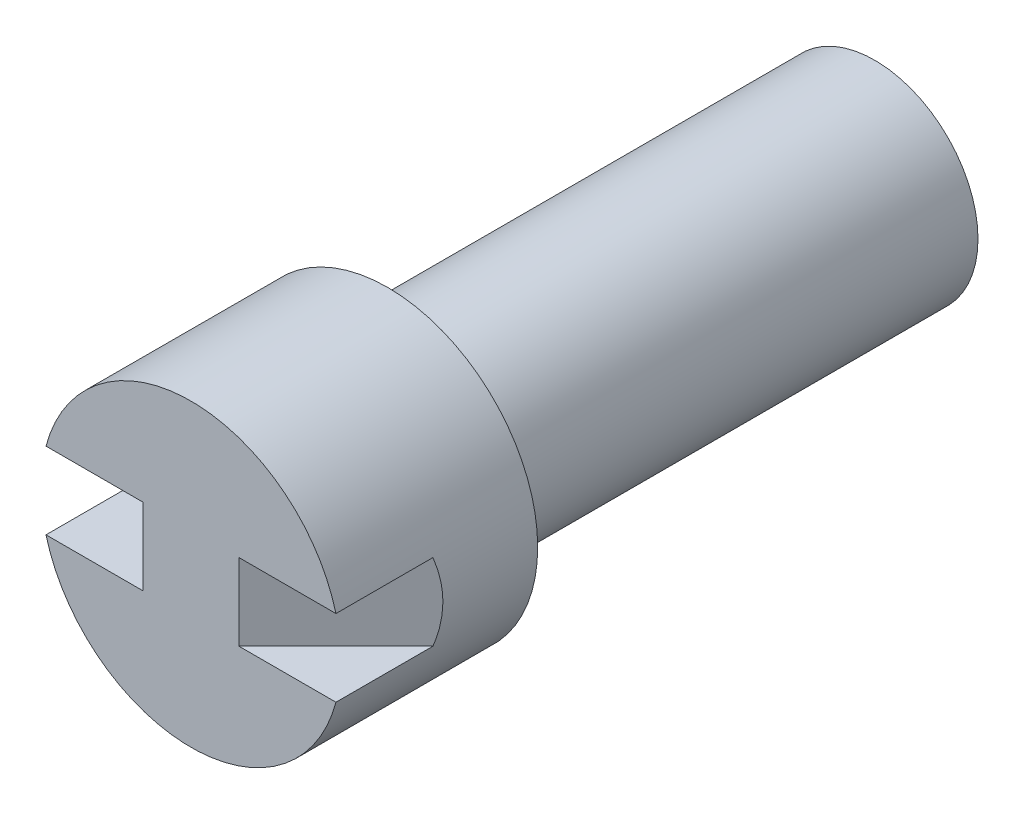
from build123d import *

# Parameters (mm, degrees)
CUT_EXTRUDE_1_DEPTH = 0.4064


with BuildPart() as part:
    # Sketch 1 → Revolve 1 (revolve)
    with BuildSketch(Plane(origin=(0, 0, 0), x_dir=(0, 0, -1), z_dir=(1, 0, 0)), mode=Mode.PRIVATE) as revolve_1_sk:
        Polygon((0, 0), (0, 1.5875), (2.0828, 1.5875), (2.0828, 1.0922), (7.239, 1.0922), (7.239, 0), align=None)
    revolve(revolve_1_sk.sketch.rotate(Axis((0, 0, 0), (0, 0, -1)), 90), axis=Axis((0, 0, 0), (0, 0, -1)))

    # Sketch 2 → Cut-Extrude 1 (cut, symmetric)
    with BuildSketch(Plane(origin=(0, 0, 0), x_dir=(1, 0, 0), z_dir=(0, 1, 0))):
        Polygon((-0.508, 0), (-1.5875, 1.0795), (-1.5875, 0), align=None)
        Polygon((0.508, 0), (1.5875, 0), (1.5875, 1.0795), align=None)
    extrude(amount=CUT_EXTRUDE_1_DEPTH, both=True, mode=Mode.SUBTRACT)


solid = part.part
